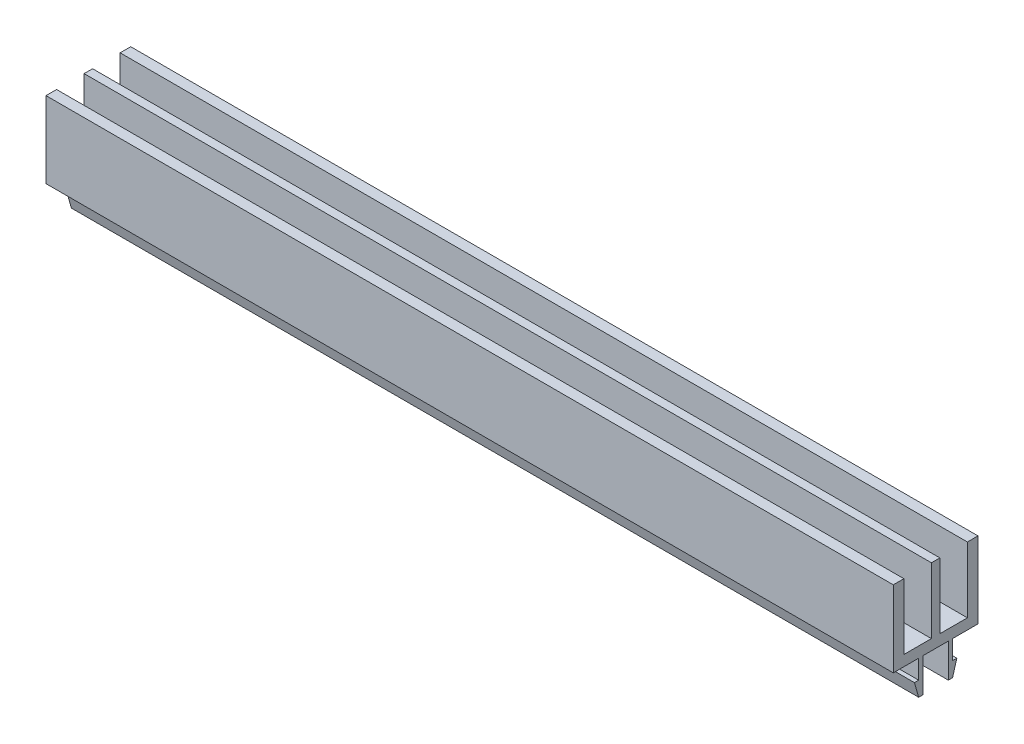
ISO-10303-21;
HEADER;
FILE_DESCRIPTION(('STEP AP214'),'2;1');
FILE_NAME('part.step','',(''),(''),'','','');
FILE_SCHEMA(('AUTOMOTIVE_DESIGN { 1 0 10303 214 1 1 1 1 }'));
ENDSEC;
DATA;
#1=APPLICATION_CONTEXT('core data for automotive mechanical design processes');
#2=APPLICATION_PROTOCOL_DEFINITION('international standard','automotive_design',2000,#1);
#3=PRODUCT_CONTEXT('',#1,'mechanical');
#4=PRODUCT('Part','Part','',(#3));
#5=PRODUCT_RELATED_PRODUCT_CATEGORY('part','',(#4));
#6=PRODUCT_DEFINITION_FORMATION('','',#4);
#7=PRODUCT_DEFINITION_CONTEXT('part definition',#1,'design');
#8=PRODUCT_DEFINITION('design','',#6,#7);
#9=PRODUCT_DEFINITION_SHAPE('','',#8);
#10=(LENGTH_UNIT() NAMED_UNIT(*) SI_UNIT(.MILLI.,.METRE.));
#11=(NAMED_UNIT(*) PLANE_ANGLE_UNIT() SI_UNIT($,.RADIAN.));
#12=(NAMED_UNIT(*) SI_UNIT($,.STERADIAN.) SOLID_ANGLE_UNIT());
#13=UNCERTAINTY_MEASURE_WITH_UNIT(LENGTH_MEASURE(1.E-05),#10,'distance_accuracy_value','');
#14=(GEOMETRIC_REPRESENTATION_CONTEXT(3) GLOBAL_UNCERTAINTY_ASSIGNED_CONTEXT((#13)) GLOBAL_UNIT_ASSIGNED_CONTEXT((#10,
#11,#12)) REPRESENTATION_CONTEXT('',''));
#15=CARTESIAN_POINT('',(0.,0.,0.));
#16=DIRECTION('',(0.,0.,1.));
#17=DIRECTION('',(1.,0.,0.));
#18=AXIS2_PLACEMENT_3D('',#15,#16,#17);
#19=CARTESIAN_POINT('',(200.,-8.910026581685,-4.65552602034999));
#20=DIRECTION('',(0.,0.,1.));
#21=DIRECTION('',(1.,0.,0.));
#22=AXIS2_PLACEMENT_3D('',#19,#20,#21);
#23=PLANE('',#22);
#24=DIRECTION('',(0.,1.,0.));
#25=VECTOR('',#24,1.);
#26=CARTESIAN_POINT('',(0.,-8.910026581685,-4.65552602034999));
#27=LINE('',#26,#25);
#28=CARTESIAN_POINT('',(0.,-8.910026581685,-4.65552602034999));
#29=VERTEX_POINT('',#28);
#30=CARTESIAN_POINT('',(0.,-4.410026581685,-4.65552602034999));
#31=VERTEX_POINT('',#30);
#32=EDGE_CURVE('E321',#29,#31,#27,.T.);
#33=ORIENTED_EDGE('',*,*,#32,.T.);
#34=DIRECTION('',(-1.,0.,0.));
#35=VECTOR('',#34,1.);
#36=CARTESIAN_POINT('',(200.,-4.410026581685,-4.65552602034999));
#37=LINE('',#36,#35);
#38=CARTESIAN_POINT('',(200.,-4.410026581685,-4.65552602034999));
#39=VERTEX_POINT('',#38);
#40=EDGE_CURVE('E13',#39,#31,#37,.T.);
#41=ORIENTED_EDGE('',*,*,#40,.F.);
#42=DIRECTION('',(0.,1.,0.));
#43=VECTOR('',#42,1.);
#44=CARTESIAN_POINT('',(200.,-8.910026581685,-4.65552602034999));
#45=LINE('',#44,#43);
#46=CARTESIAN_POINT('',(200.,-8.910026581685,-4.65552602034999));
#47=VERTEX_POINT('',#46);
#48=EDGE_CURVE('E391',#47,#39,#45,.T.);
#49=ORIENTED_EDGE('',*,*,#48,.F.);
#50=DIRECTION('',(-1.,0.,0.));
#51=VECTOR('',#50,1.);
#52=CARTESIAN_POINT('',(200.,-8.910026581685,-4.65552602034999));
#53=LINE('',#52,#51);
#54=EDGE_CURVE('E317',#47,#29,#53,.T.);
#55=ORIENTED_EDGE('',*,*,#54,.T.);
#56=EDGE_LOOP('',(#33,#41,#49,#55));
#57=FACE_BOUND('',#56,.T.);
#58=ADVANCED_FACE('F124',(#57),#23,.F.);
#59=CARTESIAN_POINT('',(200.,-4.410026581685,-4.65552602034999));
#60=DIRECTION('',(0.,1.,0.));
#61=DIRECTION('',(0.,0.,1.));
#62=AXIS2_PLACEMENT_3D('',#59,#60,#61);
#63=PLANE('',#62);
#64=DIRECTION('',(0.,0.,-1.));
#65=VECTOR('',#64,1.);
#66=CARTESIAN_POINT('',(0.,-4.410026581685,-4.65552602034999));
#67=LINE('',#66,#65);
#68=CARTESIAN_POINT('',(0.,-4.410026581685,-10.65552602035));
#69=VERTEX_POINT('',#68);
#70=EDGE_CURVE('E325',#31,#69,#67,.T.);
#71=ORIENTED_EDGE('',*,*,#70,.T.);
#72=DIRECTION('',(-1.,0.,0.));
#73=VECTOR('',#72,1.);
#74=CARTESIAN_POINT('',(200.,-4.410026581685,-10.65552602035));
#75=LINE('',#74,#73);
#76=CARTESIAN_POINT('',(200.,-4.410026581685,-10.65552602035));
#77=VERTEX_POINT('',#76);
#78=EDGE_CURVE('E133',#77,#69,#75,.T.);
#79=ORIENTED_EDGE('',*,*,#78,.F.);
#80=DIRECTION('',(0.,0.,-1.));
#81=VECTOR('',#80,1.);
#82=CARTESIAN_POINT('',(200.,-4.410026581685,-4.65552602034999));
#83=LINE('',#82,#81);
#84=EDGE_CURVE('E232',#39,#77,#83,.T.);
#85=ORIENTED_EDGE('',*,*,#84,.F.);
#86=ORIENTED_EDGE('',*,*,#40,.T.);
#87=EDGE_LOOP('',(#71,#79,#85,#86));
#88=FACE_BOUND('',#87,.T.);
#89=ADVANCED_FACE('F569',(#88),#63,.F.);
#90=CARTESIAN_POINT('',(200.,-4.410026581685,-10.65552602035));
#91=DIRECTION('',(0.,0.,1.));
#92=DIRECTION('',(1.,0.,0.));
#93=AXIS2_PLACEMENT_3D('',#90,#91,#92);
#94=PLANE('',#93);
#95=DIRECTION('',(0.,1.,0.));
#96=VECTOR('',#95,1.);
#97=CARTESIAN_POINT('',(0.,-4.410026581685,-10.65552602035));
#98=LINE('',#97,#96);
#99=CARTESIAN_POINT('',(0.,13.589973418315,-10.65552602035));
#100=VERTEX_POINT('',#99);
#101=EDGE_CURVE('E328',#69,#100,#98,.T.);
#102=ORIENTED_EDGE('',*,*,#101,.T.);
#103=DIRECTION('',(-1.,0.,0.));
#104=VECTOR('',#103,1.);
#105=CARTESIAN_POINT('',(200.,13.589973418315,-10.65552602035));
#106=LINE('',#105,#104);
#107=CARTESIAN_POINT('',(200.,13.589973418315,-10.65552602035));
#108=VERTEX_POINT('',#107);
#109=EDGE_CURVE('E466',#108,#100,#106,.T.);
#110=ORIENTED_EDGE('',*,*,#109,.F.);
#111=DIRECTION('',(0.,1.,0.));
#112=VECTOR('',#111,1.);
#113=CARTESIAN_POINT('',(200.,-4.410026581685,-10.65552602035));
#114=LINE('',#113,#112);
#115=EDGE_CURVE('E476',#77,#108,#114,.T.);
#116=ORIENTED_EDGE('',*,*,#115,.F.);
#117=ORIENTED_EDGE('',*,*,#78,.T.);
#118=EDGE_LOOP('',(#102,#110,#116,#117));
#119=FACE_BOUND('',#118,.T.);
#120=ADVANCED_FACE('F474',(#119),#94,.F.);
#121=CARTESIAN_POINT('',(200.,13.589973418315,-10.65552602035));
#122=DIRECTION('',(0.,-1.,0.));
#123=DIRECTION('',(0.,0.,-1.));
#124=AXIS2_PLACEMENT_3D('',#121,#122,#123);
#125=PLANE('',#124);
#126=DIRECTION('',(0.,0.,1.));
#127=VECTOR('',#126,1.);
#128=CARTESIAN_POINT('',(0.,13.589973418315,-10.65552602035));
#129=LINE('',#128,#127);
#130=CARTESIAN_POINT('',(0.,13.589973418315,-8.15552602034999));
#131=VERTEX_POINT('',#130);
#132=EDGE_CURVE('E331',#100,#131,#129,.T.);
#133=ORIENTED_EDGE('',*,*,#132,.T.);
#134=DIRECTION('',(-1.,0.,0.));
#135=VECTOR('',#134,1.);
#136=CARTESIAN_POINT('',(200.,13.589973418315,-8.15552602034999));
#137=LINE('',#136,#135);
#138=CARTESIAN_POINT('',(200.,13.589973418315,-8.15552602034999));
#139=VERTEX_POINT('',#138);
#140=EDGE_CURVE('E462',#139,#131,#137,.T.);
#141=ORIENTED_EDGE('',*,*,#140,.F.);
#142=DIRECTION('',(0.,0.,1.));
#143=VECTOR('',#142,1.);
#144=CARTESIAN_POINT('',(200.,13.589973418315,-10.65552602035));
#145=LINE('',#144,#143);
#146=EDGE_CURVE('E495',#108,#139,#145,.T.);
#147=ORIENTED_EDGE('',*,*,#146,.F.);
#148=ORIENTED_EDGE('',*,*,#109,.T.);
#149=EDGE_LOOP('',(#133,#141,#147,#148));
#150=FACE_BOUND('',#149,.T.);
#151=ADVANCED_FACE('F485',(#150),#125,.F.);
#152=CARTESIAN_POINT('',(200.,13.589973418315,-8.15552602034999));
#153=DIRECTION('',(0.,0.,-1.));
#154=DIRECTION('',(-1.,0.,0.));
#155=AXIS2_PLACEMENT_3D('',#152,#153,#154);
#156=PLANE('',#155);
#157=DIRECTION('',(0.,-1.,0.));
#158=VECTOR('',#157,1.);
#159=CARTESIAN_POINT('',(0.,13.589973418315,-8.15552602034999));
#160=LINE('',#159,#158);
#161=CARTESIAN_POINT('',(0.,-1.910026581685,-8.15552602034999));
#162=VERTEX_POINT('',#161);
#163=EDGE_CURVE('E334',#131,#162,#160,.T.);
#164=ORIENTED_EDGE('',*,*,#163,.T.);
#165=DIRECTION('',(-1.,0.,0.));
#166=VECTOR('',#165,1.);
#167=CARTESIAN_POINT('',(200.,-1.910026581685,-8.15552602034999));
#168=LINE('',#167,#166);
#169=CARTESIAN_POINT('',(200.,-1.910026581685,-8.15552602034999));
#170=VERTEX_POINT('',#169);
#171=EDGE_CURVE('E458',#170,#162,#168,.T.);
#172=ORIENTED_EDGE('',*,*,#171,.F.);
#173=DIRECTION('',(0.,-1.,0.));
#174=VECTOR('',#173,1.);
#175=CARTESIAN_POINT('',(200.,13.589973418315,-8.15552602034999));
#176=LINE('',#175,#174);
#177=EDGE_CURVE('E491',#139,#170,#176,.T.);
#178=ORIENTED_EDGE('',*,*,#177,.F.);
#179=ORIENTED_EDGE('',*,*,#140,.T.);
#180=EDGE_LOOP('',(#164,#172,#178,#179));
#181=FACE_BOUND('',#180,.T.);
#182=ADVANCED_FACE('F489',(#181),#156,.F.);
#183=CARTESIAN_POINT('',(200.,-1.910026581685,-8.15552602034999));
#184=DIRECTION('',(0.,-1.,0.));
#185=DIRECTION('',(0.,0.,-1.));
#186=AXIS2_PLACEMENT_3D('',#183,#184,#185);
#187=PLANE('',#186);
#188=DIRECTION('',(0.,0.,1.));
#189=VECTOR('',#188,1.);
#190=CARTESIAN_POINT('',(0.,-1.910026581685,-8.15552602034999));
#191=LINE('',#190,#189);
#192=CARTESIAN_POINT('',(0.,-1.910026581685,-1.65552602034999));
#193=VERTEX_POINT('',#192);
#194=EDGE_CURVE('E337',#162,#193,#191,.T.);
#195=ORIENTED_EDGE('',*,*,#194,.T.);
#196=DIRECTION('',(-1.,0.,0.));
#197=VECTOR('',#196,1.);
#198=CARTESIAN_POINT('',(200.,-1.910026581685,-1.65552602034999));
#199=LINE('',#198,#197);
#200=CARTESIAN_POINT('',(200.,-1.910026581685,-1.65552602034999));
#201=VERTEX_POINT('',#200);
#202=EDGE_CURVE('E454',#201,#193,#199,.T.);
#203=ORIENTED_EDGE('',*,*,#202,.F.);
#204=DIRECTION('',(0.,0.,1.));
#205=VECTOR('',#204,1.);
#206=CARTESIAN_POINT('',(200.,-1.910026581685,-8.15552602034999));
#207=LINE('',#206,#205);
#208=EDGE_CURVE('E494',#170,#201,#207,.T.);
#209=ORIENTED_EDGE('',*,*,#208,.F.);
#210=ORIENTED_EDGE('',*,*,#171,.T.);
#211=EDGE_LOOP('',(#195,#203,#209,#210));
#212=FACE_BOUND('',#211,.T.);
#213=ADVANCED_FACE('F582',(#212),#187,.F.);
#214=CARTESIAN_POINT('',(200.,-1.910026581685,-1.65552602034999));
#215=DIRECTION('',(0.,0.,1.));
#216=DIRECTION('',(1.,0.,0.));
#217=AXIS2_PLACEMENT_3D('',#214,#215,#216);
#218=PLANE('',#217);
#219=DIRECTION('',(0.,1.,0.));
#220=VECTOR('',#219,1.);
#221=CARTESIAN_POINT('',(0.,-1.910026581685,-1.65552602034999));
#222=LINE('',#221,#220);
#223=CARTESIAN_POINT('',(0.,13.589973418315,-1.65552602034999));
#224=VERTEX_POINT('',#223);
#225=EDGE_CURVE('E340',#193,#224,#222,.T.);
#226=ORIENTED_EDGE('',*,*,#225,.T.);
#227=DIRECTION('',(-1.,0.,0.));
#228=VECTOR('',#227,1.);
#229=CARTESIAN_POINT('',(200.,13.589973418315,-1.65552602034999));
#230=LINE('',#229,#228);
#231=CARTESIAN_POINT('',(200.,13.589973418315,-1.65552602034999));
#232=VERTEX_POINT('',#231);
#233=EDGE_CURVE('E450',#232,#224,#230,.T.);
#234=ORIENTED_EDGE('',*,*,#233,.F.);
#235=DIRECTION('',(0.,1.,0.));
#236=VECTOR('',#235,1.);
#237=CARTESIAN_POINT('',(200.,-1.910026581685,-1.65552602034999));
#238=LINE('',#237,#236);
#239=EDGE_CURVE('E499',#201,#232,#238,.T.);
#240=ORIENTED_EDGE('',*,*,#239,.F.);
#241=ORIENTED_EDGE('',*,*,#202,.T.);
#242=EDGE_LOOP('',(#226,#234,#240,#241));
#243=FACE_BOUND('',#242,.T.);
#244=ADVANCED_FACE('F585',(#243),#218,.F.);
#245=CARTESIAN_POINT('',(200.,13.589973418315,-1.65552602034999));
#246=DIRECTION('',(0.,-1.,0.));
#247=DIRECTION('',(0.,0.,-1.));
#248=AXIS2_PLACEMENT_3D('',#245,#246,#247);
#249=PLANE('',#248);
#250=DIRECTION('',(0.,0.,1.));
#251=VECTOR('',#250,1.);
#252=CARTESIAN_POINT('',(0.,13.589973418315,-1.65552602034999));
#253=LINE('',#252,#251);
#254=CARTESIAN_POINT('',(0.,13.589973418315,0.344473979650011));
#255=VERTEX_POINT('',#254);
#256=EDGE_CURVE('E343',#224,#255,#253,.T.);
#257=ORIENTED_EDGE('',*,*,#256,.T.);
#258=DIRECTION('',(-1.,0.,0.));
#259=VECTOR('',#258,1.);
#260=CARTESIAN_POINT('',(200.,13.589973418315,0.344473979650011));
#261=LINE('',#260,#259);
#262=CARTESIAN_POINT('',(200.,13.589973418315,0.344473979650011));
#263=VERTEX_POINT('',#262);
#264=EDGE_CURVE('E446',#263,#255,#261,.T.);
#265=ORIENTED_EDGE('',*,*,#264,.F.);
#266=DIRECTION('',(0.,0.,1.));
#267=VECTOR('',#266,1.);
#268=CARTESIAN_POINT('',(200.,13.589973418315,-1.65552602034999));
#269=LINE('',#268,#267);
#270=EDGE_CURVE('E506',#232,#263,#269,.T.);
#271=ORIENTED_EDGE('',*,*,#270,.F.);
#272=ORIENTED_EDGE('',*,*,#233,.T.);
#273=EDGE_LOOP('',(#257,#265,#271,#272));
#274=FACE_BOUND('',#273,.T.);
#275=ADVANCED_FACE('F589',(#274),#249,.F.);
#276=CARTESIAN_POINT('',(200.,13.589973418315,0.344473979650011));
#277=DIRECTION('',(0.,0.,-1.));
#278=DIRECTION('',(-1.,0.,0.));
#279=AXIS2_PLACEMENT_3D('',#276,#277,#278);
#280=PLANE('',#279);
#281=DIRECTION('',(0.,-1.,0.));
#282=VECTOR('',#281,1.);
#283=CARTESIAN_POINT('',(0.,13.589973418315,0.344473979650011));
#284=LINE('',#283,#282);
#285=CARTESIAN_POINT('',(0.,-1.910026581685,0.344473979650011));
#286=VERTEX_POINT('',#285);
#287=EDGE_CURVE('E346',#255,#286,#284,.T.);
#288=ORIENTED_EDGE('',*,*,#287,.T.);
#289=DIRECTION('',(-1.,0.,0.));
#290=VECTOR('',#289,1.);
#291=CARTESIAN_POINT('',(200.,-1.910026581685,0.344473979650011));
#292=LINE('',#291,#290);
#293=CARTESIAN_POINT('',(200.,-1.910026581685,0.344473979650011));
#294=VERTEX_POINT('',#293);
#295=EDGE_CURVE('E442',#294,#286,#292,.T.);
#296=ORIENTED_EDGE('',*,*,#295,.F.);
#297=DIRECTION('',(0.,-1.,0.));
#298=VECTOR('',#297,1.);
#299=CARTESIAN_POINT('',(200.,13.589973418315,0.344473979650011));
#300=LINE('',#299,#298);
#301=EDGE_CURVE('E509',#263,#294,#300,.T.);
#302=ORIENTED_EDGE('',*,*,#301,.F.);
#303=ORIENTED_EDGE('',*,*,#264,.T.);
#304=EDGE_LOOP('',(#288,#296,#302,#303));
#305=FACE_BOUND('',#304,.T.);
#306=ADVANCED_FACE('F593',(#305),#280,.F.);
#307=CARTESIAN_POINT('',(200.,-1.910026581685,0.344473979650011));
#308=DIRECTION('',(0.,-1.,0.));
#309=DIRECTION('',(0.,0.,-1.));
#310=AXIS2_PLACEMENT_3D('',#307,#308,#309);
#311=PLANE('',#310);
#312=DIRECTION('',(0.,0.,1.));
#313=VECTOR('',#312,1.);
#314=CARTESIAN_POINT('',(0.,-1.910026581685,0.344473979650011));
#315=LINE('',#314,#313);
#316=CARTESIAN_POINT('',(0.,-1.910026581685,6.84447397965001));
#317=VERTEX_POINT('',#316);
#318=EDGE_CURVE('E349',#286,#317,#315,.T.);
#319=ORIENTED_EDGE('',*,*,#318,.T.);
#320=DIRECTION('',(-1.,0.,0.));
#321=VECTOR('',#320,1.);
#322=CARTESIAN_POINT('',(200.,-1.910026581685,6.84447397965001));
#323=LINE('',#322,#321);
#324=CARTESIAN_POINT('',(200.,-1.910026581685,6.84447397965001));
#325=VERTEX_POINT('',#324);
#326=EDGE_CURVE('E438',#325,#317,#323,.T.);
#327=ORIENTED_EDGE('',*,*,#326,.F.);
#328=DIRECTION('',(0.,0.,1.));
#329=VECTOR('',#328,1.);
#330=CARTESIAN_POINT('',(200.,-1.910026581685,0.344473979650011));
#331=LINE('',#330,#329);
#332=EDGE_CURVE('E512',#294,#325,#331,.T.);
#333=ORIENTED_EDGE('',*,*,#332,.F.);
#334=ORIENTED_EDGE('',*,*,#295,.T.);
#335=EDGE_LOOP('',(#319,#327,#333,#334));
#336=FACE_BOUND('',#335,.T.);
#337=ADVANCED_FACE('F597',(#336),#311,.F.);
#338=CARTESIAN_POINT('',(200.,-1.910026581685,6.84447397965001));
#339=DIRECTION('',(0.,0.,1.));
#340=DIRECTION('',(1.,0.,0.));
#341=AXIS2_PLACEMENT_3D('',#338,#339,#340);
#342=PLANE('',#341);
#343=DIRECTION('',(0.,1.,0.));
#344=VECTOR('',#343,1.);
#345=CARTESIAN_POINT('',(0.,-1.910026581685,6.84447397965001));
#346=LINE('',#345,#344);
#347=CARTESIAN_POINT('',(0.,13.589973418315,6.84447397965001));
#348=VERTEX_POINT('',#347);
#349=EDGE_CURVE('E352',#317,#348,#346,.T.);
#350=ORIENTED_EDGE('',*,*,#349,.T.);
#351=DIRECTION('',(-1.,0.,0.));
#352=VECTOR('',#351,1.);
#353=CARTESIAN_POINT('',(200.,13.589973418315,6.84447397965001));
#354=LINE('',#353,#352);
#355=CARTESIAN_POINT('',(200.,13.589973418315,6.84447397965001));
#356=VERTEX_POINT('',#355);
#357=EDGE_CURVE('E434',#356,#348,#354,.T.);
#358=ORIENTED_EDGE('',*,*,#357,.F.);
#359=DIRECTION('',(0.,1.,0.));
#360=VECTOR('',#359,1.);
#361=CARTESIAN_POINT('',(200.,-1.910026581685,6.84447397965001));
#362=LINE('',#361,#360);
#363=EDGE_CURVE('E515',#325,#356,#362,.T.);
#364=ORIENTED_EDGE('',*,*,#363,.F.);
#365=ORIENTED_EDGE('',*,*,#326,.T.);
#366=EDGE_LOOP('',(#350,#358,#364,#365));
#367=FACE_BOUND('',#366,.T.);
#368=ADVANCED_FACE('F601',(#367),#342,.F.);
#369=CARTESIAN_POINT('',(200.,13.589973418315,6.84447397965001));
#370=DIRECTION('',(0.,-1.,0.));
#371=DIRECTION('',(0.,0.,-1.));
#372=AXIS2_PLACEMENT_3D('',#369,#370,#371);
#373=PLANE('',#372);
#374=DIRECTION('',(0.,0.,1.));
#375=VECTOR('',#374,1.);
#376=CARTESIAN_POINT('',(0.,13.589973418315,6.84447397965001));
#377=LINE('',#376,#375);
#378=CARTESIAN_POINT('',(0.,13.589973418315,9.34447397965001));
#379=VERTEX_POINT('',#378);
#380=EDGE_CURVE('E355',#348,#379,#377,.T.);
#381=ORIENTED_EDGE('',*,*,#380,.T.);
#382=DIRECTION('',(-1.,0.,0.));
#383=VECTOR('',#382,1.);
#384=CARTESIAN_POINT('',(200.,13.589973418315,9.34447397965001));
#385=LINE('',#384,#383);
#386=CARTESIAN_POINT('',(200.,13.589973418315,9.34447397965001));
#387=VERTEX_POINT('',#386);
#388=EDGE_CURVE('E430',#387,#379,#385,.T.);
#389=ORIENTED_EDGE('',*,*,#388,.F.);
#390=DIRECTION('',(0.,0.,1.));
#391=VECTOR('',#390,1.);
#392=CARTESIAN_POINT('',(200.,13.589973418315,6.84447397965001));
#393=LINE('',#392,#391);
#394=EDGE_CURVE('E518',#356,#387,#393,.T.);
#395=ORIENTED_EDGE('',*,*,#394,.F.);
#396=ORIENTED_EDGE('',*,*,#357,.T.);
#397=EDGE_LOOP('',(#381,#389,#395,#396));
#398=FACE_BOUND('',#397,.T.);
#399=ADVANCED_FACE('F605',(#398),#373,.F.);
#400=CARTESIAN_POINT('',(200.,13.589973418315,9.34447397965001));
#401=DIRECTION('',(0.,0.,-1.));
#402=DIRECTION('',(-1.,0.,0.));
#403=AXIS2_PLACEMENT_3D('',#400,#401,#402);
#404=PLANE('',#403);
#405=DIRECTION('',(0.,-1.,0.));
#406=VECTOR('',#405,1.);
#407=CARTESIAN_POINT('',(0.,13.589973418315,9.34447397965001));
#408=LINE('',#407,#406);
#409=CARTESIAN_POINT('',(0.,-4.410026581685,9.34447397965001));
#410=VERTEX_POINT('',#409);
#411=EDGE_CURVE('E358',#379,#410,#408,.T.);
#412=ORIENTED_EDGE('',*,*,#411,.T.);
#413=DIRECTION('',(-1.,0.,0.));
#414=VECTOR('',#413,1.);
#415=CARTESIAN_POINT('',(200.,-4.410026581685,9.34447397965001));
#416=LINE('',#415,#414);
#417=CARTESIAN_POINT('',(200.,-4.410026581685,9.34447397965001));
#418=VERTEX_POINT('',#417);
#419=EDGE_CURVE('E426',#418,#410,#416,.T.);
#420=ORIENTED_EDGE('',*,*,#419,.F.);
#421=DIRECTION('',(0.,-1.,0.));
#422=VECTOR('',#421,1.);
#423=CARTESIAN_POINT('',(200.,13.589973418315,9.34447397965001));
#424=LINE('',#423,#422);
#425=EDGE_CURVE('E521',#387,#418,#424,.T.);
#426=ORIENTED_EDGE('',*,*,#425,.F.);
#427=ORIENTED_EDGE('',*,*,#388,.T.);
#428=EDGE_LOOP('',(#412,#420,#426,#427));
#429=FACE_BOUND('',#428,.T.);
#430=ADVANCED_FACE('F609',(#429),#404,.F.);
#431=CARTESIAN_POINT('',(200.,-4.410026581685,9.34447397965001));
#432=DIRECTION('',(0.,1.,0.));
#433=DIRECTION('',(0.,0.,1.));
#434=AXIS2_PLACEMENT_3D('',#431,#432,#433);
#435=PLANE('',#434);
#436=DIRECTION('',(0.,0.,-1.));
#437=VECTOR('',#436,1.);
#438=CARTESIAN_POINT('',(0.,-4.410026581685,9.34447397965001));
#439=LINE('',#438,#437);
#440=CARTESIAN_POINT('',(0.,-4.410026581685,3.34447397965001));
#441=VERTEX_POINT('',#440);
#442=EDGE_CURVE('E361',#410,#441,#439,.T.);
#443=ORIENTED_EDGE('',*,*,#442,.T.);
#444=DIRECTION('',(-1.,0.,0.));
#445=VECTOR('',#444,1.);
#446=CARTESIAN_POINT('',(200.,-4.410026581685,3.34447397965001));
#447=LINE('',#446,#445);
#448=CARTESIAN_POINT('',(200.,-4.410026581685,3.34447397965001));
#449=VERTEX_POINT('',#448);
#450=EDGE_CURVE('E422',#449,#441,#447,.T.);
#451=ORIENTED_EDGE('',*,*,#450,.F.);
#452=DIRECTION('',(0.,0.,-1.));
#453=VECTOR('',#452,1.);
#454=CARTESIAN_POINT('',(200.,-4.410026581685,9.34447397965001));
#455=LINE('',#454,#453);
#456=EDGE_CURVE('E524',#418,#449,#455,.T.);
#457=ORIENTED_EDGE('',*,*,#456,.F.);
#458=ORIENTED_EDGE('',*,*,#419,.T.);
#459=EDGE_LOOP('',(#443,#451,#457,#458));
#460=FACE_BOUND('',#459,.T.);
#461=ADVANCED_FACE('F613',(#460),#435,.F.);
#462=CARTESIAN_POINT('',(200.,-4.410026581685,3.34447397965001));
#463=DIRECTION('',(0.,0.,-1.));
#464=DIRECTION('',(-1.,0.,0.));
#465=AXIS2_PLACEMENT_3D('',#462,#463,#464);
#466=PLANE('',#465);
#467=DIRECTION('',(0.,-1.,0.));
#468=VECTOR('',#467,1.);
#469=CARTESIAN_POINT('',(0.,-4.410026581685,3.34447397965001));
#470=LINE('',#469,#468);
#471=CARTESIAN_POINT('',(0.,-8.910026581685,3.34447397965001));
#472=VERTEX_POINT('',#471);
#473=EDGE_CURVE('E364',#441,#472,#470,.T.);
#474=ORIENTED_EDGE('',*,*,#473,.T.);
#475=DIRECTION('',(-1.,0.,0.));
#476=VECTOR('',#475,1.);
#477=CARTESIAN_POINT('',(200.,-8.910026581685,3.34447397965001));
#478=LINE('',#477,#476);
#479=CARTESIAN_POINT('',(200.,-8.910026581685,3.34447397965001));
#480=VERTEX_POINT('',#479);
#481=EDGE_CURVE('E418',#480,#472,#478,.T.);
#482=ORIENTED_EDGE('',*,*,#481,.F.);
#483=DIRECTION('',(0.,-1.,0.));
#484=VECTOR('',#483,1.);
#485=CARTESIAN_POINT('',(200.,-4.410026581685,3.34447397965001));
#486=LINE('',#485,#484);
#487=EDGE_CURVE('E527',#449,#480,#486,.T.);
#488=ORIENTED_EDGE('',*,*,#487,.F.);
#489=ORIENTED_EDGE('',*,*,#450,.T.);
#490=EDGE_LOOP('',(#474,#482,#488,#489));
#491=FACE_BOUND('',#490,.T.);
#492=ADVANCED_FACE('F617',(#491),#466,.F.);
#493=CARTESIAN_POINT('',(200.,-8.910026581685,3.34447397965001));
#494=DIRECTION('',(0.,-1.,0.));
#495=DIRECTION('',(0.,0.,-1.));
#496=AXIS2_PLACEMENT_3D('',#493,#494,#495);
#497=PLANE('',#496);
#498=DIRECTION('',(0.,0.,1.));
#499=VECTOR('',#498,1.);
#500=CARTESIAN_POINT('',(0.,-8.910026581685,3.34447397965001));
#501=LINE('',#500,#499);
#502=CARTESIAN_POINT('',(0.,-8.910026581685,4.34447397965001));
#503=VERTEX_POINT('',#502);
#504=EDGE_CURVE('E367',#472,#503,#501,.T.);
#505=ORIENTED_EDGE('',*,*,#504,.T.);
#506=DIRECTION('',(-1.,0.,0.));
#507=VECTOR('',#506,1.);
#508=CARTESIAN_POINT('',(200.,-8.910026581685,4.34447397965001));
#509=LINE('',#508,#507);
#510=CARTESIAN_POINT('',(200.,-8.910026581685,4.34447397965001));
#511=VERTEX_POINT('',#510);
#512=EDGE_CURVE('E414',#511,#503,#509,.T.);
#513=ORIENTED_EDGE('',*,*,#512,.F.);
#514=DIRECTION('',(0.,0.,1.));
#515=VECTOR('',#514,1.);
#516=CARTESIAN_POINT('',(200.,-8.910026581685,3.34447397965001));
#517=LINE('',#516,#515);
#518=EDGE_CURVE('E530',#480,#511,#517,.T.);
#519=ORIENTED_EDGE('',*,*,#518,.F.);
#520=ORIENTED_EDGE('',*,*,#481,.T.);
#521=EDGE_LOOP('',(#505,#513,#519,#520));
#522=FACE_BOUND('',#521,.T.);
#523=ADVANCED_FACE('F621',(#522),#497,.F.);
#524=CARTESIAN_POINT('',(200.,-8.910026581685,4.34447397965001));
#525=DIRECTION('',(0.,0.274721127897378,-0.961523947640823));
#526=DIRECTION('',(0.,0.961523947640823,0.274721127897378));
#527=AXIS2_PLACEMENT_3D('',#524,#525,#526);
#528=PLANE('',#527);
#529=DIRECTION('',(0.,-0.961523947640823,-0.274721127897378));
#530=VECTOR('',#529,1.);
#531=CARTESIAN_POINT('',(0.,-8.910026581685,4.34447397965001));
#532=LINE('',#531,#530);
#533=CARTESIAN_POINT('',(0.,-12.410026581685,3.34447397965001));
#534=VERTEX_POINT('',#533);
#535=EDGE_CURVE('E370',#503,#534,#532,.T.);
#536=ORIENTED_EDGE('',*,*,#535,.T.);
#537=DIRECTION('',(-1.,0.,0.));
#538=VECTOR('',#537,1.);
#539=CARTESIAN_POINT('',(200.,-12.410026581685,3.34447397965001));
#540=LINE('',#539,#538);
#541=CARTESIAN_POINT('',(200.,-12.410026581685,3.34447397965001));
#542=VERTEX_POINT('',#541);
#543=EDGE_CURVE('E410',#542,#534,#540,.T.);
#544=ORIENTED_EDGE('',*,*,#543,.F.);
#545=DIRECTION('',(0.,-0.961523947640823,-0.274721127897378));
#546=VECTOR('',#545,1.);
#547=CARTESIAN_POINT('',(200.,-8.910026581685,4.34447397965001));
#548=LINE('',#547,#546);
#549=EDGE_CURVE('E533',#511,#542,#548,.T.);
#550=ORIENTED_EDGE('',*,*,#549,.F.);
#551=ORIENTED_EDGE('',*,*,#512,.T.);
#552=EDGE_LOOP('',(#536,#544,#550,#551));
#553=FACE_BOUND('',#552,.T.);
#554=ADVANCED_FACE('F625',(#553),#528,.F.);
#555=CARTESIAN_POINT('',(200.,-12.410026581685,3.34447397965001));
#556=DIRECTION('',(0.,1.,0.));
#557=DIRECTION('',(0.,0.,1.));
#558=AXIS2_PLACEMENT_3D('',#555,#556,#557);
#559=PLANE('',#558);
#560=DIRECTION('',(0.,0.,-1.));
#561=VECTOR('',#560,1.);
#562=CARTESIAN_POINT('',(0.,-12.410026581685,3.34447397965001));
#563=LINE('',#562,#561);
#564=CARTESIAN_POINT('',(0.,-12.410026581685,2.34447397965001));
#565=VERTEX_POINT('',#564);
#566=EDGE_CURVE('E373',#534,#565,#563,.T.);
#567=ORIENTED_EDGE('',*,*,#566,.T.);
#568=DIRECTION('',(-1.,0.,0.));
#569=VECTOR('',#568,1.);
#570=CARTESIAN_POINT('',(200.,-12.410026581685,2.34447397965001));
#571=LINE('',#570,#569);
#572=CARTESIAN_POINT('',(200.,-12.410026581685,2.34447397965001));
#573=VERTEX_POINT('',#572);
#574=EDGE_CURVE('E406',#573,#565,#571,.T.);
#575=ORIENTED_EDGE('',*,*,#574,.F.);
#576=DIRECTION('',(0.,0.,-1.));
#577=VECTOR('',#576,1.);
#578=CARTESIAN_POINT('',(200.,-12.410026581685,3.34447397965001));
#579=LINE('',#578,#577);
#580=EDGE_CURVE('E536',#542,#573,#579,.T.);
#581=ORIENTED_EDGE('',*,*,#580,.F.);
#582=ORIENTED_EDGE('',*,*,#543,.T.);
#583=EDGE_LOOP('',(#567,#575,#581,#582));
#584=FACE_BOUND('',#583,.T.);
#585=ADVANCED_FACE('F629',(#584),#559,.F.);
#586=CARTESIAN_POINT('',(200.,-12.410026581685,2.34447397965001));
#587=DIRECTION('',(0.,0.,1.));
#588=DIRECTION('',(1.,0.,0.));
#589=AXIS2_PLACEMENT_3D('',#586,#587,#588);
#590=PLANE('',#589);
#591=DIRECTION('',(0.,1.,0.));
#592=VECTOR('',#591,1.);
#593=CARTESIAN_POINT('',(0.,-12.410026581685,2.34447397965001));
#594=LINE('',#593,#592);
#595=CARTESIAN_POINT('',(0.,-4.410026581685,2.34447397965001));
#596=VERTEX_POINT('',#595);
#597=EDGE_CURVE('E376',#565,#596,#594,.T.);
#598=ORIENTED_EDGE('',*,*,#597,.T.);
#599=DIRECTION('',(-1.,0.,0.));
#600=VECTOR('',#599,1.);
#601=CARTESIAN_POINT('',(200.,-4.410026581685,2.34447397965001));
#602=LINE('',#601,#600);
#603=CARTESIAN_POINT('',(200.,-4.410026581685,2.34447397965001));
#604=VERTEX_POINT('',#603);
#605=EDGE_CURVE('E402',#604,#596,#602,.T.);
#606=ORIENTED_EDGE('',*,*,#605,.F.);
#607=DIRECTION('',(0.,1.,0.));
#608=VECTOR('',#607,1.);
#609=CARTESIAN_POINT('',(200.,-12.410026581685,2.34447397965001));
#610=LINE('',#609,#608);
#611=EDGE_CURVE('E539',#573,#604,#610,.T.);
#612=ORIENTED_EDGE('',*,*,#611,.F.);
#613=ORIENTED_EDGE('',*,*,#574,.T.);
#614=EDGE_LOOP('',(#598,#606,#612,#613));
#615=FACE_BOUND('',#614,.T.);
#616=ADVANCED_FACE('F633',(#615),#590,.F.);
#617=CARTESIAN_POINT('',(200.,-4.410026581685,2.34447397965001));
#618=DIRECTION('',(0.,1.,0.));
#619=DIRECTION('',(0.,0.,1.));
#620=AXIS2_PLACEMENT_3D('',#617,#618,#619);
#621=PLANE('',#620);
#622=DIRECTION('',(0.,0.,-1.));
#623=VECTOR('',#622,1.);
#624=CARTESIAN_POINT('',(0.,-4.410026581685,2.34447397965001));
#625=LINE('',#624,#623);
#626=CARTESIAN_POINT('',(0.,-4.410026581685,-3.65552602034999));
#627=VERTEX_POINT('',#626);
#628=EDGE_CURVE('E379',#596,#627,#625,.T.);
#629=ORIENTED_EDGE('',*,*,#628,.T.);
#630=DIRECTION('',(-1.,0.,0.));
#631=VECTOR('',#630,1.);
#632=CARTESIAN_POINT('',(200.,-4.410026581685,-3.65552602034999));
#633=LINE('',#632,#631);
#634=CARTESIAN_POINT('',(200.,-4.410026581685,-3.65552602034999));
#635=VERTEX_POINT('',#634);
#636=EDGE_CURVE('E398',#635,#627,#633,.T.);
#637=ORIENTED_EDGE('',*,*,#636,.F.);
#638=DIRECTION('',(0.,0.,-1.));
#639=VECTOR('',#638,1.);
#640=CARTESIAN_POINT('',(200.,-4.410026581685,2.34447397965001));
#641=LINE('',#640,#639);
#642=EDGE_CURVE('E542',#604,#635,#641,.T.);
#643=ORIENTED_EDGE('',*,*,#642,.F.);
#644=ORIENTED_EDGE('',*,*,#605,.T.);
#645=EDGE_LOOP('',(#629,#637,#643,#644));
#646=FACE_BOUND('',#645,.T.);
#647=ADVANCED_FACE('F550',(#646),#621,.F.);
#648=CARTESIAN_POINT('',(200.,-4.410026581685,-3.65552602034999));
#649=DIRECTION('',(0.,0.,-1.));
#650=DIRECTION('',(-1.,0.,0.));
#651=AXIS2_PLACEMENT_3D('',#648,#649,#650);
#652=PLANE('',#651);
#653=DIRECTION('',(0.,-1.,0.));
#654=VECTOR('',#653,1.);
#655=CARTESIAN_POINT('',(0.,-4.410026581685,-3.65552602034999));
#656=LINE('',#655,#654);
#657=CARTESIAN_POINT('',(0.,-12.410026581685,-3.65552602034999));
#658=VERTEX_POINT('',#657);
#659=EDGE_CURVE('E382',#627,#658,#656,.T.);
#660=ORIENTED_EDGE('',*,*,#659,.T.);
#661=DIRECTION('',(-1.,0.,0.));
#662=VECTOR('',#661,1.);
#663=CARTESIAN_POINT('',(200.,-12.410026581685,-3.65552602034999));
#664=LINE('',#663,#662);
#665=CARTESIAN_POINT('',(200.,-12.410026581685,-3.65552602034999));
#666=VERTEX_POINT('',#665);
#667=EDGE_CURVE('E310',#666,#658,#664,.T.);
#668=ORIENTED_EDGE('',*,*,#667,.F.);
#669=DIRECTION('',(0.,-1.,0.));
#670=VECTOR('',#669,1.);
#671=CARTESIAN_POINT('',(200.,-4.410026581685,-3.65552602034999));
#672=LINE('',#671,#670);
#673=EDGE_CURVE('E299',#635,#666,#672,.T.);
#674=ORIENTED_EDGE('',*,*,#673,.F.);
#675=ORIENTED_EDGE('',*,*,#636,.T.);
#676=EDGE_LOOP('',(#660,#668,#674,#675));
#677=FACE_BOUND('',#676,.T.);
#678=ADVANCED_FACE('F554',(#677),#652,.F.);
#679=CARTESIAN_POINT('',(200.,-12.410026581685,-3.65552602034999));
#680=DIRECTION('',(0.,1.,0.));
#681=DIRECTION('',(0.,0.,1.));
#682=AXIS2_PLACEMENT_3D('',#679,#680,#681);
#683=PLANE('',#682);
#684=DIRECTION('',(0.,0.,-1.));
#685=VECTOR('',#684,1.);
#686=CARTESIAN_POINT('',(0.,-12.410026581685,-3.65552602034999));
#687=LINE('',#686,#685);
#688=CARTESIAN_POINT('',(0.,-12.410026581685,-4.65552602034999));
#689=VERTEX_POINT('',#688);
#690=EDGE_CURVE('E308',#658,#689,#687,.T.);
#691=ORIENTED_EDGE('',*,*,#690,.T.);
#692=DIRECTION('',(-1.,0.,0.));
#693=VECTOR('',#692,1.);
#694=CARTESIAN_POINT('',(200.,-12.410026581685,-4.65552602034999));
#695=LINE('',#694,#693);
#696=CARTESIAN_POINT('',(200.,-12.410026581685,-4.65552602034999));
#697=VERTEX_POINT('',#696);
#698=EDGE_CURVE('E305',#697,#689,#695,.T.);
#699=ORIENTED_EDGE('',*,*,#698,.F.);
#700=DIRECTION('',(0.,0.,-1.));
#701=VECTOR('',#700,1.);
#702=CARTESIAN_POINT('',(200.,-12.410026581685,-3.65552602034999));
#703=LINE('',#702,#701);
#704=EDGE_CURVE('E293',#666,#697,#703,.T.);
#705=ORIENTED_EDGE('',*,*,#704,.F.);
#706=ORIENTED_EDGE('',*,*,#667,.T.);
#707=EDGE_LOOP('',(#691,#699,#705,#706));
#708=FACE_BOUND('',#707,.T.);
#709=ADVANCED_FACE('F306',(#708),#683,.F.);
#710=CARTESIAN_POINT('',(200.,-12.410026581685,-4.65552602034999));
#711=DIRECTION('',(0.,0.274721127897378,0.961523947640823));
#712=DIRECTION('',(0.,-0.961523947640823,0.274721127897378));
#713=AXIS2_PLACEMENT_3D('',#710,#711,#712);
#714=PLANE('',#713);
#715=DIRECTION('',(0.,0.961523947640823,-0.274721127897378));
#716=VECTOR('',#715,1.);
#717=CARTESIAN_POINT('',(0.,-12.410026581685,-4.65552602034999));
#718=LINE('',#717,#716);
#719=CARTESIAN_POINT('',(0.,-8.910026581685,-5.65552602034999));
#720=VERTEX_POINT('',#719);
#721=EDGE_CURVE('E218',#689,#720,#718,.T.);
#722=ORIENTED_EDGE('',*,*,#721,.T.);
#723=DIRECTION('',(-1.,0.,0.));
#724=VECTOR('',#723,1.);
#725=CARTESIAN_POINT('',(200.,-8.910026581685,-5.65552602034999));
#726=LINE('',#725,#724);
#727=CARTESIAN_POINT('',(200.,-8.910026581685,-5.65552602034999));
#728=VERTEX_POINT('',#727);
#729=EDGE_CURVE('E311',#728,#720,#726,.T.);
#730=ORIENTED_EDGE('',*,*,#729,.F.);
#731=DIRECTION('',(0.,0.961523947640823,-0.274721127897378));
#732=VECTOR('',#731,1.);
#733=CARTESIAN_POINT('',(200.,-12.410026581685,-4.65552602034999));
#734=LINE('',#733,#732);
#735=EDGE_CURVE('E297',#697,#728,#734,.T.);
#736=ORIENTED_EDGE('',*,*,#735,.F.);
#737=ORIENTED_EDGE('',*,*,#698,.T.);
#738=EDGE_LOOP('',(#722,#730,#736,#737));
#739=FACE_BOUND('',#738,.T.);
#740=ADVANCED_FACE('F313',(#739),#714,.F.);
#741=CARTESIAN_POINT('',(200.,-8.910026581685,-5.65552602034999));
#742=DIRECTION('',(0.,-1.,0.));
#743=DIRECTION('',(0.,0.,-1.));
#744=AXIS2_PLACEMENT_3D('',#741,#742,#743);
#745=PLANE('',#744);
#746=DIRECTION('',(0.,0.,1.));
#747=VECTOR('',#746,1.);
#748=CARTESIAN_POINT('',(0.,-8.910026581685,-5.65552602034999));
#749=LINE('',#748,#747);
#750=EDGE_CURVE('E224',#720,#29,#749,.T.);
#751=ORIENTED_EDGE('',*,*,#750,.T.);
#752=ORIENTED_EDGE('',*,*,#54,.F.);
#753=DIRECTION('',(0.,0.,1.));
#754=VECTOR('',#753,1.);
#755=CARTESIAN_POINT('',(200.,-8.910026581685,-5.65552602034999));
#756=LINE('',#755,#754);
#757=EDGE_CURVE('E141',#728,#47,#756,.T.);
#758=ORIENTED_EDGE('',*,*,#757,.F.);
#759=ORIENTED_EDGE('',*,*,#729,.T.);
#760=EDGE_LOOP('',(#751,#752,#758,#759));
#761=FACE_BOUND('',#760,.T.);
#762=ADVANCED_FACE('F558',(#761),#745,.F.);
#763=CARTESIAN_POINT('',(200.,0.,0.));
#764=DIRECTION('',(-1.,0.,0.));
#765=DIRECTION('',(0.,0.,1.));
#766=AXIS2_PLACEMENT_3D('',#763,#764,#765);
#767=PLANE('',#766);
#768=ORIENTED_EDGE('',*,*,#48,.T.);
#769=ORIENTED_EDGE('',*,*,#84,.T.);
#770=ORIENTED_EDGE('',*,*,#115,.T.);
#771=ORIENTED_EDGE('',*,*,#146,.T.);
#772=ORIENTED_EDGE('',*,*,#177,.T.);
#773=ORIENTED_EDGE('',*,*,#208,.T.);
#774=ORIENTED_EDGE('',*,*,#239,.T.);
#775=ORIENTED_EDGE('',*,*,#270,.T.);
#776=ORIENTED_EDGE('',*,*,#301,.T.);
#777=ORIENTED_EDGE('',*,*,#332,.T.);
#778=ORIENTED_EDGE('',*,*,#363,.T.);
#779=ORIENTED_EDGE('',*,*,#394,.T.);
#780=ORIENTED_EDGE('',*,*,#425,.T.);
#781=ORIENTED_EDGE('',*,*,#456,.T.);
#782=ORIENTED_EDGE('',*,*,#487,.T.);
#783=ORIENTED_EDGE('',*,*,#518,.T.);
#784=ORIENTED_EDGE('',*,*,#549,.T.);
#785=ORIENTED_EDGE('',*,*,#580,.T.);
#786=ORIENTED_EDGE('',*,*,#611,.T.);
#787=ORIENTED_EDGE('',*,*,#642,.T.);
#788=ORIENTED_EDGE('',*,*,#673,.T.);
#789=ORIENTED_EDGE('',*,*,#704,.T.);
#790=ORIENTED_EDGE('',*,*,#735,.T.);
#791=ORIENTED_EDGE('',*,*,#757,.T.);
#792=EDGE_LOOP('',(#768,#769,#770,#771,#772,#773,#774,#775,#776,#777,#778,#779,#780,#781,#782,
#783,#784,#785,#786,#787,#788,#789,#790,#791));
#793=FACE_BOUND('',#792,.T.);
#794=ADVANCED_FACE('F295',(#793),#767,.F.);
#795=CARTESIAN_POINT('',(0.,0.,0.));
#796=DIRECTION('',(-1.,0.,0.));
#797=DIRECTION('',(0.,0.,1.));
#798=AXIS2_PLACEMENT_3D('',#795,#796,#797);
#799=PLANE('',#798);
#800=ORIENTED_EDGE('',*,*,#32,.F.);
#801=ORIENTED_EDGE('',*,*,#750,.F.);
#802=ORIENTED_EDGE('',*,*,#721,.F.);
#803=ORIENTED_EDGE('',*,*,#690,.F.);
#804=ORIENTED_EDGE('',*,*,#659,.F.);
#805=ORIENTED_EDGE('',*,*,#628,.F.);
#806=ORIENTED_EDGE('',*,*,#597,.F.);
#807=ORIENTED_EDGE('',*,*,#566,.F.);
#808=ORIENTED_EDGE('',*,*,#535,.F.);
#809=ORIENTED_EDGE('',*,*,#504,.F.);
#810=ORIENTED_EDGE('',*,*,#473,.F.);
#811=ORIENTED_EDGE('',*,*,#442,.F.);
#812=ORIENTED_EDGE('',*,*,#411,.F.);
#813=ORIENTED_EDGE('',*,*,#380,.F.);
#814=ORIENTED_EDGE('',*,*,#349,.F.);
#815=ORIENTED_EDGE('',*,*,#318,.F.);
#816=ORIENTED_EDGE('',*,*,#287,.F.);
#817=ORIENTED_EDGE('',*,*,#256,.F.);
#818=ORIENTED_EDGE('',*,*,#225,.F.);
#819=ORIENTED_EDGE('',*,*,#194,.F.);
#820=ORIENTED_EDGE('',*,*,#163,.F.);
#821=ORIENTED_EDGE('',*,*,#132,.F.);
#822=ORIENTED_EDGE('',*,*,#101,.F.);
#823=ORIENTED_EDGE('',*,*,#70,.F.);
#824=EDGE_LOOP('',(#800,#801,#802,#803,#804,#805,#806,#807,#808,#809,#810,#811,#812,#813,#814,
#815,#816,#817,#818,#819,#820,#821,#822,#823));
#825=FACE_BOUND('',#824,.T.);
#826=ADVANCED_FACE('F480',(#825),#799,.T.);
#827=CLOSED_SHELL('',(#58,#89,#120,#151,#182,#213,#244,#275,#306,#337,#368,#399,#430,#461,#492,
#523,#554,#585,#616,#647,#678,#709,#740,#762,#794,#826));
#828=MANIFOLD_SOLID_BREP('B2',#827);
#829=ADVANCED_BREP_SHAPE_REPRESENTATION('',(#18,#828),#14);
#830=SHAPE_DEFINITION_REPRESENTATION(#9,#829);
ENDSEC;
END-ISO-10303-21;
